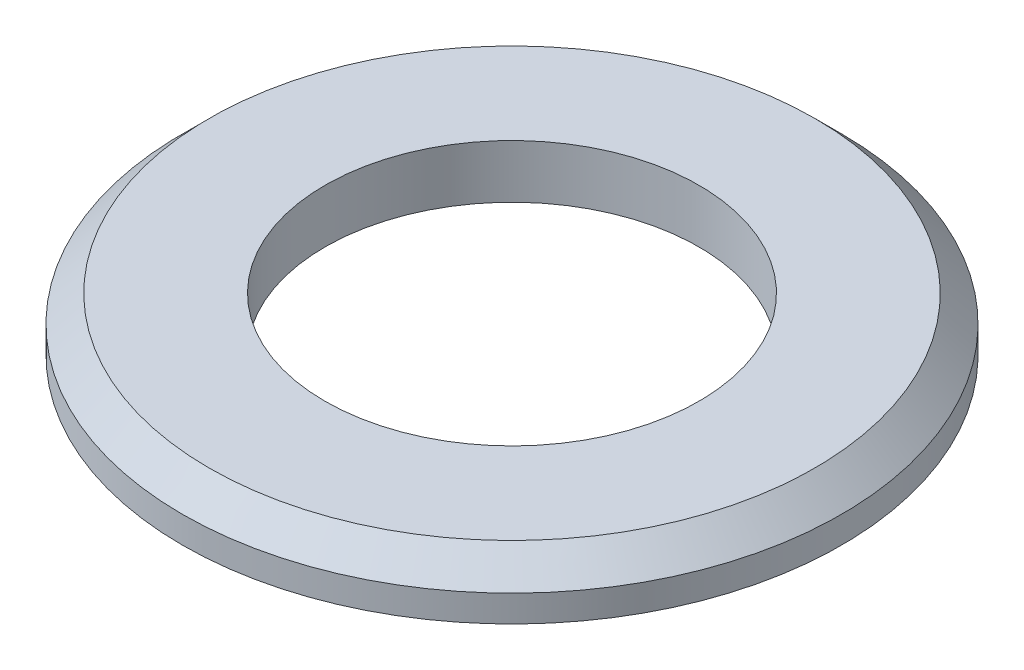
ISO-10303-21;
HEADER;
FILE_DESCRIPTION(('STEP AP214'),'2;1');
FILE_NAME('part.step','',(''),(''),'','','');
FILE_SCHEMA(('AUTOMOTIVE_DESIGN { 1 0 10303 214 1 1 1 1 }'));
ENDSEC;
DATA;
#1=APPLICATION_CONTEXT('core data for automotive mechanical design processes');
#2=APPLICATION_PROTOCOL_DEFINITION('international standard','automotive_design',2000,#1);
#3=PRODUCT_CONTEXT('',#1,'mechanical');
#4=PRODUCT('Part','Part','',(#3));
#5=PRODUCT_RELATED_PRODUCT_CATEGORY('part','',(#4));
#6=PRODUCT_DEFINITION_FORMATION('','',#4);
#7=PRODUCT_DEFINITION_CONTEXT('part definition',#1,'design');
#8=PRODUCT_DEFINITION('design','',#6,#7);
#9=PRODUCT_DEFINITION_SHAPE('','',#8);
#10=(LENGTH_UNIT() NAMED_UNIT(*) SI_UNIT(.MILLI.,.METRE.));
#11=(NAMED_UNIT(*) PLANE_ANGLE_UNIT() SI_UNIT($,.RADIAN.));
#12=(NAMED_UNIT(*) SI_UNIT($,.STERADIAN.) SOLID_ANGLE_UNIT());
#13=UNCERTAINTY_MEASURE_WITH_UNIT(LENGTH_MEASURE(1.E-05),#10,'distance_accuracy_value','');
#14=(GEOMETRIC_REPRESENTATION_CONTEXT(3) GLOBAL_UNCERTAINTY_ASSIGNED_CONTEXT((#13)) GLOBAL_UNIT_ASSIGNED_CONTEXT((#10,
#11,#12)) REPRESENTATION_CONTEXT('',''));
#15=CARTESIAN_POINT('',(0.,0.,0.));
#16=DIRECTION('',(0.,0.,1.));
#17=DIRECTION('',(1.,0.,0.));
#18=AXIS2_PLACEMENT_3D('',#15,#16,#17);
#19=CARTESIAN_POINT('',(0.,3.,0.));
#20=DIRECTION('',(0.,1.,0.));
#21=DIRECTION('',(0.,0.,1.));
#22=AXIS2_PLACEMENT_3D('',#19,#20,#21);
#23=PLANE('',#22);
#24=CARTESIAN_POINT('',(0.,3.,0.));
#25=DIRECTION('',(0.,1.,0.));
#26=DIRECTION('',(0.,0.,1.));
#27=AXIS2_PLACEMENT_3D('',#24,#25,#26);
#28=CIRCLE('',#27,17.);
#29=CARTESIAN_POINT('',(0.,3.,17.));
#30=VERTEX_POINT('',#29);
#31=EDGE_CURVE('E35',#30,#30,#28,.T.);
#32=ORIENTED_EDGE('',*,*,#31,.T.);
#33=EDGE_LOOP('',(#32));
#34=FACE_BOUND('',#33,.T.);
#35=CARTESIAN_POINT('',(0.,3.,0.));
#36=DIRECTION('',(0.,1.,0.));
#37=DIRECTION('',(0.,0.,1.));
#38=AXIS2_PLACEMENT_3D('',#35,#36,#37);
#39=CIRCLE('',#38,10.5);
#40=CARTESIAN_POINT('',(0.,3.,10.5));
#41=VERTEX_POINT('',#40);
#42=EDGE_CURVE('E43',#41,#41,#39,.T.);
#43=ORIENTED_EDGE('',*,*,#42,.F.);
#44=EDGE_LOOP('',(#43));
#45=FACE_BOUND('',#44,.T.);
#46=ADVANCED_FACE('F28',(#34,#45),#23,.T.);
#47=CARTESIAN_POINT('',(0.,0.,0.));
#48=DIRECTION('',(0.,1.,0.));
#49=DIRECTION('',(0.,0.,1.));
#50=AXIS2_PLACEMENT_3D('',#47,#48,#49);
#51=PLANE('',#50);
#52=CARTESIAN_POINT('',(0.,0.,0.));
#53=DIRECTION('',(0.,1.,0.));
#54=DIRECTION('',(0.,0.,1.));
#55=AXIS2_PLACEMENT_3D('',#52,#53,#54);
#56=CIRCLE('',#55,18.5);
#57=CARTESIAN_POINT('',(0.,0.,18.5));
#58=VERTEX_POINT('',#57);
#59=EDGE_CURVE('E39',#58,#58,#56,.T.);
#60=ORIENTED_EDGE('',*,*,#59,.F.);
#61=EDGE_LOOP('',(#60));
#62=FACE_BOUND('',#61,.T.);
#63=CARTESIAN_POINT('',(0.,0.,0.));
#64=DIRECTION('',(0.,1.,0.));
#65=DIRECTION('',(0.,0.,1.));
#66=AXIS2_PLACEMENT_3D('',#63,#64,#65);
#67=CIRCLE('',#66,10.5);
#68=CARTESIAN_POINT('',(0.,0.,10.5));
#69=VERTEX_POINT('',#68);
#70=EDGE_CURVE('E48',#69,#69,#67,.T.);
#71=ORIENTED_EDGE('',*,*,#70,.T.);
#72=EDGE_LOOP('',(#71));
#73=FACE_BOUND('',#72,.T.);
#74=ADVANCED_FACE('F52',(#62,#73),#51,.F.);
#75=CARTESIAN_POINT('',(0.,3.,0.));
#76=DIRECTION('',(0.,-1.,0.));
#77=DIRECTION('',(0.,0.,-1.));
#78=AXIS2_PLACEMENT_3D('',#75,#76,#77);
#79=CYLINDRICAL_SURFACE('',#78,18.5);
#80=CARTESIAN_POINT('',(0.,1.5,0.));
#81=DIRECTION('',(0.,1.,0.));
#82=DIRECTION('',(0.,0.,1.));
#83=AXIS2_PLACEMENT_3D('',#80,#81,#82);
#84=CIRCLE('',#83,18.5);
#85=CARTESIAN_POINT('',(0.,1.5,18.5));
#86=VERTEX_POINT('',#85);
#87=EDGE_CURVE('E10',#86,#86,#84,.F.);
#88=ORIENTED_EDGE('',*,*,#87,.T.);
#89=EDGE_LOOP('',(#88));
#90=FACE_BOUND('',#89,.T.);
#91=ORIENTED_EDGE('',*,*,#59,.T.);
#92=EDGE_LOOP('',(#91));
#93=FACE_BOUND('',#92,.T.);
#94=ADVANCED_FACE('F30',(#90,#93),#79,.T.);
#95=CARTESIAN_POINT('',(0.,3.,0.));
#96=DIRECTION('',(0.,-1.,0.));
#97=DIRECTION('',(0.,0.,-1.));
#98=AXIS2_PLACEMENT_3D('',#95,#96,#97);
#99=CYLINDRICAL_SURFACE('',#98,10.5);
#100=ORIENTED_EDGE('',*,*,#42,.T.);
#101=EDGE_LOOP('',(#100));
#102=FACE_BOUND('',#101,.T.);
#103=ORIENTED_EDGE('',*,*,#70,.F.);
#104=EDGE_LOOP('',(#103));
#105=FACE_BOUND('',#104,.T.);
#106=ADVANCED_FACE('F54',(#102,#105),#99,.F.);
#107=CARTESIAN_POINT('',(0.,3.,0.));
#108=DIRECTION('',(0.,-1.,0.));
#109=DIRECTION('',(0.,0.,-1.));
#110=AXIS2_PLACEMENT_3D('',#107,#108,#109);
#111=CONICAL_SURFACE('',#110,17.,0.785398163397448);
#112=ORIENTED_EDGE('',*,*,#87,.F.);
#113=EDGE_LOOP('',(#112));
#114=FACE_BOUND('',#113,.T.);
#115=ORIENTED_EDGE('',*,*,#31,.F.);
#116=EDGE_LOOP('',(#115));
#117=FACE_BOUND('',#116,.T.);
#118=ADVANCED_FACE('F56',(#114,#117),#111,.T.);
#119=CLOSED_SHELL('',(#46,#74,#94,#106,#118));
#120=MANIFOLD_SOLID_BREP('B2',#119);
#121=ADVANCED_BREP_SHAPE_REPRESENTATION('',(#18,#120),#14);
#122=SHAPE_DEFINITION_REPRESENTATION(#9,#121);
ENDSEC;
END-ISO-10303-21;
